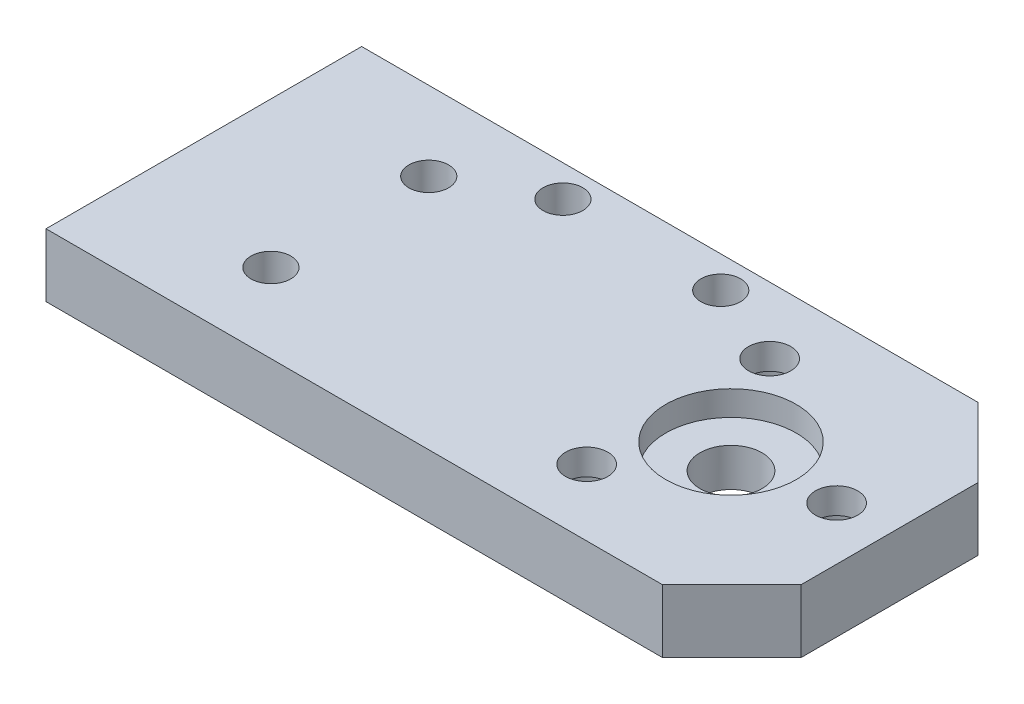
from build123d import *

# Parameters (mm, degrees)
SKETCH1_W                      = 55.1815
SKETCH1_H                      = 25.4
BOSS_EXTRUDE1_DEPTH            = 5.08
SKETCH2_R                      = 2.5
CUT_EXTRUDE1_DEPTH             = 6
SKETCH3_R                      = 5.25
CUT_EXTRUDE2_DEPTH             = 2
CBORE_FOR_M3_SHCS2_D           = 3.4
CBORE_FOR_M3_SHCS2_DEPTH       = 6
CBORE_FOR_M3_SHCS2_CBORE_D     = 6.5
CBORE_FOR_M3_SHCS2_CBORE_DEPTH = 3
CBORE_FOR_M3_SHCS2_TIP         = 1.021463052
CHAMFER1_SIZE                  = 5.588
M3_CLEARANCE_HOLE1_D           = 3.2
M3_CLEARANCE_HOLE1_DEPTH       = 8.26


with BuildPart() as part:
    # Sketch1 → Boss-Extrude1 (new body)
    with BuildSketch(Plane(origin=(0, 0, 0), x_dir=(1, 0, 0), z_dir=(0, 1, 0))):
        with Locations((27.59075, 12.7)):
            Rectangle(SKETCH1_W, SKETCH1_H)
    extrude(amount=BOSS_EXTRUDE1_DEPTH)

    # Sketch2 → Cut-Extrude1 (cut)
    with BuildSketch(Plane(origin=(0, 5.08, 0), x_dir=(1, 0, 0), z_dir=(0, 1, 0))):
        with Locations(Location((42.4175, 12.7, 0), (0, 0, 270))):
            Circle(SKETCH2_R)
    extrude(amount=-CUT_EXTRUDE1_DEPTH, mode=Mode.SUBTRACT)

    # Sketch3 → Cut-Extrude2 (cut)
    with BuildSketch(Plane(origin=(0, 5.08, 0), x_dir=(1, 0, 0), z_dir=(0, 1, 0))):
        with Locations(Location((42.4175, 12.7, 0), (0, 0, 270))):
            Circle(SKETCH3_R)
    extrude(amount=-CUT_EXTRUDE2_DEPTH, mode=Mode.SUBTRACT)

    # CBORE for M3 SHCS2
    with Locations(Plane(origin=(0, 0, 0), x_dir=(-1, 0, 0), z_dir=(0, -1, 0))):
        with Locations((-50.9175, 12.7), (-38.1675, 5.338784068), (-38.1675, 20.061215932)):
            CounterBoreHole(CBORE_FOR_M3_SHCS2_D / 2, CBORE_FOR_M3_SHCS2_CBORE_D / 2, CBORE_FOR_M3_SHCS2_CBORE_DEPTH, depth=CBORE_FOR_M3_SHCS2_DEPTH)
            with Locations((0, 0, -(CBORE_FOR_M3_SHCS2_DEPTH + CBORE_FOR_M3_SHCS2_TIP / 2))):  # 118° drill point
                Cone(0, CBORE_FOR_M3_SHCS2_D / 2, CBORE_FOR_M3_SHCS2_TIP, mode=Mode.SUBTRACT)

    # Chamfer1
    chamfer1_edges = [part.edges().sort_by_distance(p)[0] for p in [
        (55.1815, 2.54, -25.4),
        (55.1815, 2.54, 0),
    ]]
    chamfer(chamfer1_edges, length=CHAMFER1_SIZE)

    # M3 Clearance Hole1
    with Locations(Plane(origin=(0, 5.08, 0), x_dir=(1, 0, 0), z_dir=(0, 1, 0))):
        with Locations((31.4325, 22.86), (18.7325, 22.86), (11.7475, 19.05), (11.7475, 6.35)):
            Hole(M3_CLEARANCE_HOLE1_D / 2, depth=M3_CLEARANCE_HOLE1_DEPTH)


solid = part.part
